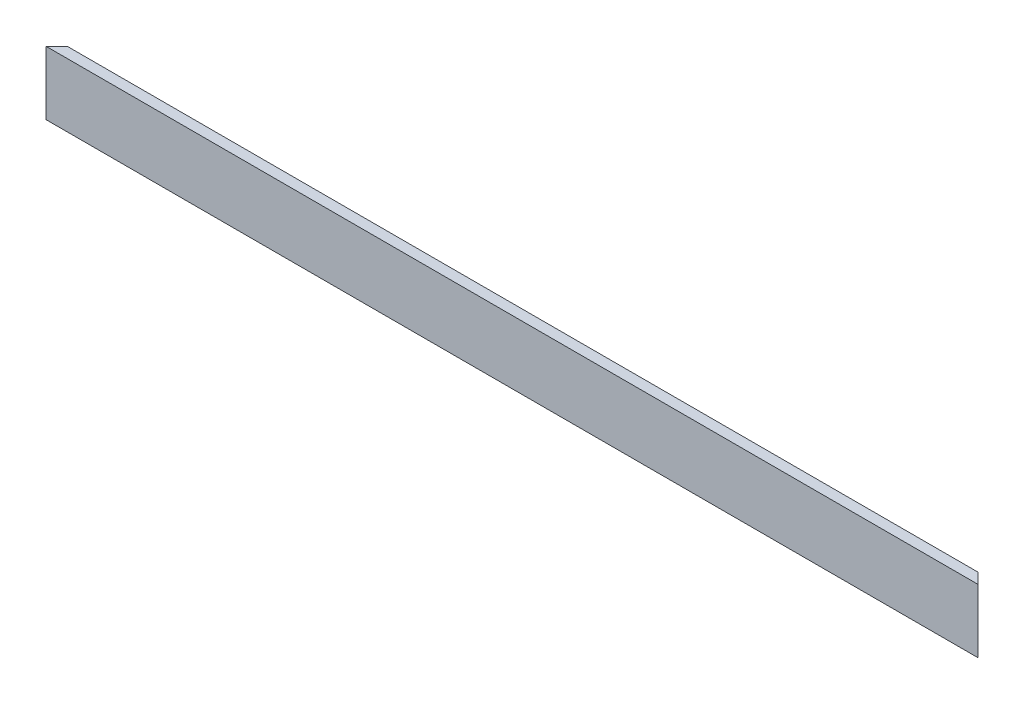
from build123d import *

# Parameters (mm, degrees)
BOSS_EXTRUDE1_DEPTH = 558.8
CUT_EXTRUDE3_DEPTH  = 562.391717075


with BuildPart() as part:
    # Sketch1 → Boss-Extrude1 (new body)
    with BuildSketch(Plane(origin=(0, 0, 0), x_dir=(0, 0, -1), z_dir=(1, 0, 0))):
        Polygon((0, 0), (0, 38.1), (6.35, 38.1), (6.35, 6.35), (38.1, 6.35), (38.1, 0), align=None)
    extrude(amount=BOSS_EXTRUDE1_DEPTH)

    # Sketch2 → Cut-Extrude3 (cut, through all)
    with BuildSketch(Plane(origin=(0, 0, 0), x_dir=(1, 0, 0), z_dir=(0, 1, 0))):
        Polygon((0, 0), (38.1, 38.1), (0, 38.1), align=None)
        Polygon((558.8, 0), (520.7, 38.1), (558.8, 38.1), align=None)
    extrude(amount=CUT_EXTRUDE3_DEPTH, mode=Mode.SUBTRACT)


solid = part.part
